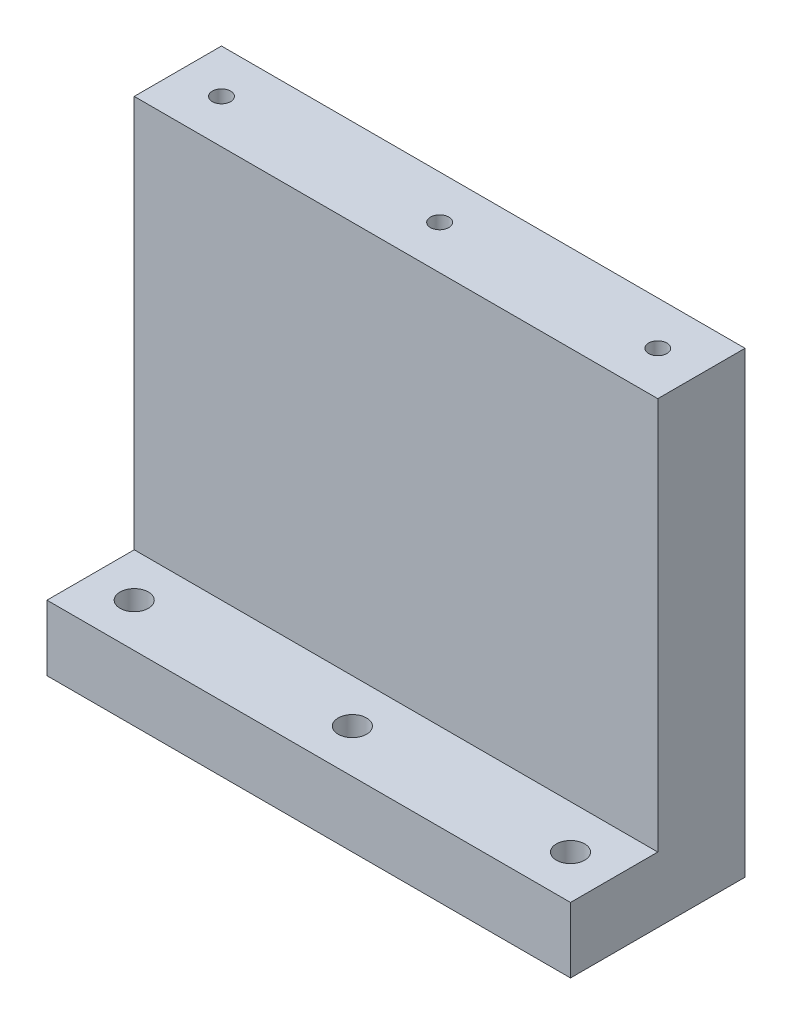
ISO-10303-21;
HEADER;
FILE_DESCRIPTION(('STEP AP214'),'2;1');
FILE_NAME('part.step','',(''),(''),'','','');
FILE_SCHEMA(('AUTOMOTIVE_DESIGN { 1 0 10303 214 1 1 1 1 }'));
ENDSEC;
DATA;
#1=APPLICATION_CONTEXT('core data for automotive mechanical design processes');
#2=APPLICATION_PROTOCOL_DEFINITION('international standard','automotive_design',2000,#1);
#3=PRODUCT_CONTEXT('',#1,'mechanical');
#4=PRODUCT('Part','Part','',(#3));
#5=PRODUCT_RELATED_PRODUCT_CATEGORY('part','',(#4));
#6=PRODUCT_DEFINITION_FORMATION('','',#4);
#7=PRODUCT_DEFINITION_CONTEXT('part definition',#1,'design');
#8=PRODUCT_DEFINITION('design','',#6,#7);
#9=PRODUCT_DEFINITION_SHAPE('','',#8);
#10=(LENGTH_UNIT() NAMED_UNIT(*) SI_UNIT(.MILLI.,.METRE.));
#11=(NAMED_UNIT(*) PLANE_ANGLE_UNIT() SI_UNIT($,.RADIAN.));
#12=(NAMED_UNIT(*) SI_UNIT($,.STERADIAN.) SOLID_ANGLE_UNIT());
#13=UNCERTAINTY_MEASURE_WITH_UNIT(LENGTH_MEASURE(1.E-05),#10,'distance_accuracy_value','');
#14=(GEOMETRIC_REPRESENTATION_CONTEXT(3) GLOBAL_UNCERTAINTY_ASSIGNED_CONTEXT((#13)) GLOBAL_UNIT_ASSIGNED_CONTEXT((#10,
#11,#12)) REPRESENTATION_CONTEXT('',''));
#15=CARTESIAN_POINT('',(0.,0.,0.));
#16=DIRECTION('',(0.,0.,1.));
#17=DIRECTION('',(1.,0.,0.));
#18=AXIS2_PLACEMENT_3D('',#15,#16,#17);
#19=CARTESIAN_POINT('',(0.,0.,40.));
#20=DIRECTION('',(1.,0.,0.));
#21=DIRECTION('',(0.,0.,-1.));
#22=AXIS2_PLACEMENT_3D('',#19,#20,#21);
#23=PLANE('',#22);
#24=DIRECTION('',(0.,0.,1.));
#25=VECTOR('',#24,1.);
#26=CARTESIAN_POINT('',(0.,15.,40.));
#27=LINE('',#26,#25);
#28=CARTESIAN_POINT('',(0.,15.,20.));
#29=VERTEX_POINT('',#28);
#30=CARTESIAN_POINT('',(0.,15.,40.));
#31=VERTEX_POINT('',#30);
#32=EDGE_CURVE('E47',#29,#31,#27,.T.);
#33=ORIENTED_EDGE('',*,*,#32,.F.);
#34=DIRECTION('',(0.,-1.,0.));
#35=VECTOR('',#34,1.);
#36=CARTESIAN_POINT('',(0.,15.,20.));
#37=LINE('',#36,#35);
#38=CARTESIAN_POINT('',(0.,105.,20.));
#39=VERTEX_POINT('',#38);
#40=EDGE_CURVE('E83',#39,#29,#37,.T.);
#41=ORIENTED_EDGE('',*,*,#40,.F.);
#42=DIRECTION('',(0.,0.,-1.));
#43=VECTOR('',#42,1.);
#44=CARTESIAN_POINT('',(0.,105.,40.));
#45=LINE('',#44,#43);
#46=CARTESIAN_POINT('',(0.,105.,0.));
#47=VERTEX_POINT('',#46);
#48=EDGE_CURVE('E76',#39,#47,#45,.T.);
#49=ORIENTED_EDGE('',*,*,#48,.T.);
#50=DIRECTION('',(0.,-1.,0.));
#51=VECTOR('',#50,1.);
#52=CARTESIAN_POINT('',(0.,0.,0.));
#53=LINE('',#52,#51);
#54=CARTESIAN_POINT('',(0.,0.,0.));
#55=VERTEX_POINT('',#54);
#56=EDGE_CURVE('E80',#47,#55,#53,.T.);
#57=ORIENTED_EDGE('',*,*,#56,.T.);
#58=DIRECTION('',(0.,0.,-1.));
#59=VECTOR('',#58,1.);
#60=CARTESIAN_POINT('',(0.,0.,40.));
#61=LINE('',#60,#59);
#62=CARTESIAN_POINT('',(0.,0.,40.));
#63=VERTEX_POINT('',#62);
#64=EDGE_CURVE('E12',#63,#55,#61,.T.);
#65=ORIENTED_EDGE('',*,*,#64,.F.);
#66=DIRECTION('',(0.,-1.,0.));
#67=VECTOR('',#66,1.);
#68=CARTESIAN_POINT('',(0.,0.,40.));
#69=LINE('',#68,#67);
#70=EDGE_CURVE('E96',#31,#63,#69,.T.);
#71=ORIENTED_EDGE('',*,*,#70,.F.);
#72=EDGE_LOOP('',(#33,#41,#49,#57,#65,#71));
#73=FACE_BOUND('',#72,.T.);
#74=ADVANCED_FACE('F33',(#73),#23,.F.);
#75=CARTESIAN_POINT('',(120.,0.,40.));
#76=DIRECTION('',(-1.,0.,0.));
#77=DIRECTION('',(0.,0.,1.));
#78=AXIS2_PLACEMENT_3D('',#75,#76,#77);
#79=PLANE('',#78);
#80=DIRECTION('',(0.,0.,1.));
#81=VECTOR('',#80,1.);
#82=CARTESIAN_POINT('',(120.,15.,40.));
#83=LINE('',#82,#81);
#84=CARTESIAN_POINT('',(120.,15.,20.));
#85=VERTEX_POINT('',#84);
#86=CARTESIAN_POINT('',(120.,15.,40.));
#87=VERTEX_POINT('',#86);
#88=EDGE_CURVE('E128',#85,#87,#83,.T.);
#89=ORIENTED_EDGE('',*,*,#88,.T.);
#90=DIRECTION('',(0.,1.,0.));
#91=VECTOR('',#90,1.);
#92=CARTESIAN_POINT('',(120.,0.,40.));
#93=LINE('',#92,#91);
#94=CARTESIAN_POINT('',(120.,0.,40.));
#95=VERTEX_POINT('',#94);
#96=EDGE_CURVE('E87',#95,#87,#93,.T.);
#97=ORIENTED_EDGE('',*,*,#96,.F.);
#98=DIRECTION('',(0.,0.,-1.));
#99=VECTOR('',#98,1.);
#100=CARTESIAN_POINT('',(120.,0.,40.));
#101=LINE('',#100,#99);
#102=CARTESIAN_POINT('',(120.,0.,0.));
#103=VERTEX_POINT('',#102);
#104=EDGE_CURVE('E40',#95,#103,#101,.T.);
#105=ORIENTED_EDGE('',*,*,#104,.T.);
#106=DIRECTION('',(0.,1.,0.));
#107=VECTOR('',#106,1.);
#108=CARTESIAN_POINT('',(120.,0.,0.));
#109=LINE('',#108,#107);
#110=CARTESIAN_POINT('',(120.,105.,0.));
#111=VERTEX_POINT('',#110);
#112=EDGE_CURVE('E97',#103,#111,#109,.T.);
#113=ORIENTED_EDGE('',*,*,#112,.T.);
#114=DIRECTION('',(0.,0.,-1.));
#115=VECTOR('',#114,1.);
#116=CARTESIAN_POINT('',(120.,105.,40.));
#117=LINE('',#116,#115);
#118=CARTESIAN_POINT('',(120.,105.,20.));
#119=VERTEX_POINT('',#118);
#120=EDGE_CURVE('E86',#119,#111,#117,.T.);
#121=ORIENTED_EDGE('',*,*,#120,.F.);
#122=DIRECTION('',(0.,-1.,0.));
#123=VECTOR('',#122,1.);
#124=CARTESIAN_POINT('',(120.,15.,20.));
#125=LINE('',#124,#123);
#126=EDGE_CURVE('E125',#119,#85,#125,.T.);
#127=ORIENTED_EDGE('',*,*,#126,.T.);
#128=EDGE_LOOP('',(#89,#97,#105,#113,#121,#127));
#129=FACE_BOUND('',#128,.T.);
#130=ADVANCED_FACE('F115',(#129),#79,.F.);
#131=CARTESIAN_POINT('',(0.,105.,40.));
#132=DIRECTION('',(0.,-1.,0.));
#133=DIRECTION('',(0.,0.,-1.));
#134=AXIS2_PLACEMENT_3D('',#131,#132,#133);
#135=PLANE('',#134);
#136=CARTESIAN_POINT('',(110.,105.,10.));
#137=DIRECTION('',(0.,1.,0.));
#138=DIRECTION('',(0.,0.,1.));
#139=AXIS2_PLACEMENT_3D('',#136,#137,#138);
#140=CIRCLE('',#139,2.1);
#141=CARTESIAN_POINT('',(110.,105.,12.1));
#142=VERTEX_POINT('',#141);
#143=EDGE_CURVE('E163',#142,#142,#140,.T.);
#144=ORIENTED_EDGE('',*,*,#143,.F.);
#145=EDGE_LOOP('',(#144));
#146=FACE_BOUND('',#145,.T.);
#147=CARTESIAN_POINT('',(60.,105.,10.0000000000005));
#148=DIRECTION('',(0.,1.,0.));
#149=DIRECTION('',(0.,0.,1.));
#150=AXIS2_PLACEMENT_3D('',#147,#148,#149);
#151=CIRCLE('',#150,2.1);
#152=CARTESIAN_POINT('',(60.,105.,12.1000000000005));
#153=VERTEX_POINT('',#152);
#154=EDGE_CURVE('E157',#153,#153,#151,.T.);
#155=ORIENTED_EDGE('',*,*,#154,.F.);
#156=EDGE_LOOP('',(#155));
#157=FACE_BOUND('',#156,.T.);
#158=CARTESIAN_POINT('',(10.,105.,10.));
#159=DIRECTION('',(0.,1.,0.));
#160=DIRECTION('',(0.,0.,1.));
#161=AXIS2_PLACEMENT_3D('',#158,#159,#160);
#162=CIRCLE('',#161,2.1);
#163=CARTESIAN_POINT('',(10.,105.,12.1));
#164=VERTEX_POINT('',#163);
#165=EDGE_CURVE('E151',#164,#164,#162,.T.);
#166=ORIENTED_EDGE('',*,*,#165,.F.);
#167=EDGE_LOOP('',(#166));
#168=FACE_BOUND('',#167,.T.);
#169=DIRECTION('',(1.,0.,0.));
#170=VECTOR('',#169,1.);
#171=CARTESIAN_POINT('',(0.,105.,20.));
#172=LINE('',#171,#170);
#173=EDGE_CURVE('E105',#39,#119,#172,.T.);
#174=ORIENTED_EDGE('',*,*,#173,.T.);
#175=ORIENTED_EDGE('',*,*,#120,.T.);
#176=DIRECTION('',(-1.,0.,0.));
#177=VECTOR('',#176,1.);
#178=CARTESIAN_POINT('',(0.,105.,0.));
#179=LINE('',#178,#177);
#180=EDGE_CURVE('E90',#111,#47,#179,.T.);
#181=ORIENTED_EDGE('',*,*,#180,.T.);
#182=ORIENTED_EDGE('',*,*,#48,.F.);
#183=EDGE_LOOP('',(#174,#175,#181,#182));
#184=FACE_BOUND('',#183,.T.);
#185=ADVANCED_FACE('F91',(#146,#157,#168,#184),#135,.F.);
#186=CARTESIAN_POINT('',(0.,105.,40.));
#187=DIRECTION('',(0.,0.,-1.));
#188=DIRECTION('',(-1.,0.,0.));
#189=AXIS2_PLACEMENT_3D('',#186,#187,#188);
#190=PLANE('',#189);
#191=DIRECTION('',(1.,0.,0.));
#192=VECTOR('',#191,1.);
#193=CARTESIAN_POINT('',(0.,15.,40.));
#194=LINE('',#193,#192);
#195=EDGE_CURVE('E122',#31,#87,#194,.T.);
#196=ORIENTED_EDGE('',*,*,#195,.F.);
#197=ORIENTED_EDGE('',*,*,#70,.T.);
#198=DIRECTION('',(1.,0.,0.));
#199=VECTOR('',#198,1.);
#200=CARTESIAN_POINT('',(0.,0.,40.));
#201=LINE('',#200,#199);
#202=EDGE_CURVE('E56',#63,#95,#201,.T.);
#203=ORIENTED_EDGE('',*,*,#202,.T.);
#204=ORIENTED_EDGE('',*,*,#96,.T.);
#205=EDGE_LOOP('',(#196,#197,#203,#204));
#206=FACE_BOUND('',#205,.T.);
#207=ADVANCED_FACE('F180',(#206),#190,.F.);
#208=CARTESIAN_POINT('',(0.,0.,40.));
#209=DIRECTION('',(0.,1.,0.));
#210=DIRECTION('',(0.,0.,1.));
#211=AXIS2_PLACEMENT_3D('',#208,#209,#210);
#212=PLANE('',#211);
#213=CARTESIAN_POINT('',(10.,0.,30.));
#214=DIRECTION('',(0.,1.,0.));
#215=DIRECTION('',(0.,0.,1.));
#216=AXIS2_PLACEMENT_3D('',#213,#214,#215);
#217=CIRCLE('',#216,3.25);
#218=CARTESIAN_POINT('',(10.,0.,33.25));
#219=VERTEX_POINT('',#218);
#220=EDGE_CURVE('E144',#219,#219,#217,.T.);
#221=ORIENTED_EDGE('',*,*,#220,.T.);
#222=EDGE_LOOP('',(#221));
#223=FACE_BOUND('',#222,.T.);
#224=CARTESIAN_POINT('',(60.,0.,30.));
#225=DIRECTION('',(0.,1.,0.));
#226=DIRECTION('',(0.,0.,1.));
#227=AXIS2_PLACEMENT_3D('',#224,#225,#226);
#228=CIRCLE('',#227,3.25);
#229=CARTESIAN_POINT('',(60.,0.,33.25));
#230=VERTEX_POINT('',#229);
#231=EDGE_CURVE('E138',#230,#230,#228,.T.);
#232=ORIENTED_EDGE('',*,*,#231,.T.);
#233=EDGE_LOOP('',(#232));
#234=FACE_BOUND('',#233,.T.);
#235=CARTESIAN_POINT('',(110.,0.,30.));
#236=DIRECTION('',(0.,1.,0.));
#237=DIRECTION('',(0.,0.,1.));
#238=AXIS2_PLACEMENT_3D('',#235,#236,#237);
#239=CIRCLE('',#238,3.25);
#240=CARTESIAN_POINT('',(110.,0.,33.25));
#241=VERTEX_POINT('',#240);
#242=EDGE_CURVE('E130',#241,#241,#239,.T.);
#243=ORIENTED_EDGE('',*,*,#242,.T.);
#244=EDGE_LOOP('',(#243));
#245=FACE_BOUND('',#244,.T.);
#246=DIRECTION('',(1.,0.,0.));
#247=VECTOR('',#246,1.);
#248=CARTESIAN_POINT('',(0.,0.,0.));
#249=LINE('',#248,#247);
#250=EDGE_CURVE('E100',#55,#103,#249,.T.);
#251=ORIENTED_EDGE('',*,*,#250,.T.);
#252=ORIENTED_EDGE('',*,*,#104,.F.);
#253=ORIENTED_EDGE('',*,*,#202,.F.);
#254=ORIENTED_EDGE('',*,*,#64,.T.);
#255=EDGE_LOOP('',(#251,#252,#253,#254));
#256=FACE_BOUND('',#255,.T.);
#257=ADVANCED_FACE('F117',(#223,#234,#245,#256),#212,.F.);
#258=CARTESIAN_POINT('',(0.,105.,0.));
#259=DIRECTION('',(0.,0.,-1.));
#260=DIRECTION('',(-1.,0.,0.));
#261=AXIS2_PLACEMENT_3D('',#258,#259,#260);
#262=PLANE('',#261);
#263=ORIENTED_EDGE('',*,*,#56,.F.);
#264=ORIENTED_EDGE('',*,*,#180,.F.);
#265=ORIENTED_EDGE('',*,*,#112,.F.);
#266=ORIENTED_EDGE('',*,*,#250,.F.);
#267=EDGE_LOOP('',(#263,#264,#265,#266));
#268=FACE_BOUND('',#267,.T.);
#269=ADVANCED_FACE('F99',(#268),#262,.T.);
#270=CARTESIAN_POINT('',(0.,15.,40.));
#271=DIRECTION('',(0.,1.,0.));
#272=DIRECTION('',(0.,0.,1.));
#273=AXIS2_PLACEMENT_3D('',#270,#271,#272);
#274=PLANE('',#273);
#275=CARTESIAN_POINT('',(10.,15.,30.));
#276=DIRECTION('',(0.,1.,0.));
#277=DIRECTION('',(0.,0.,1.));
#278=AXIS2_PLACEMENT_3D('',#275,#276,#277);
#279=CIRCLE('',#278,3.25);
#280=CARTESIAN_POINT('',(10.,15.,33.25));
#281=VERTEX_POINT('',#280);
#282=EDGE_CURVE('E147',#281,#281,#279,.T.);
#283=ORIENTED_EDGE('',*,*,#282,.F.);
#284=EDGE_LOOP('',(#283));
#285=FACE_BOUND('',#284,.T.);
#286=CARTESIAN_POINT('',(60.,15.,30.));
#287=DIRECTION('',(0.,1.,0.));
#288=DIRECTION('',(0.,0.,1.));
#289=AXIS2_PLACEMENT_3D('',#286,#287,#288);
#290=CIRCLE('',#289,3.25);
#291=CARTESIAN_POINT('',(60.,15.,33.25));
#292=VERTEX_POINT('',#291);
#293=EDGE_CURVE('E141',#292,#292,#290,.T.);
#294=ORIENTED_EDGE('',*,*,#293,.F.);
#295=EDGE_LOOP('',(#294));
#296=FACE_BOUND('',#295,.T.);
#297=CARTESIAN_POINT('',(110.,15.,30.));
#298=DIRECTION('',(0.,1.,0.));
#299=DIRECTION('',(0.,0.,1.));
#300=AXIS2_PLACEMENT_3D('',#297,#298,#299);
#301=CIRCLE('',#300,3.25);
#302=CARTESIAN_POINT('',(110.,15.,33.25));
#303=VERTEX_POINT('',#302);
#304=EDGE_CURVE('E135',#303,#303,#301,.T.);
#305=ORIENTED_EDGE('',*,*,#304,.F.);
#306=EDGE_LOOP('',(#305));
#307=FACE_BOUND('',#306,.T.);
#308=ORIENTED_EDGE('',*,*,#88,.F.);
#309=DIRECTION('',(1.,0.,0.));
#310=VECTOR('',#309,1.);
#311=CARTESIAN_POINT('',(0.,15.,20.));
#312=LINE('',#311,#310);
#313=EDGE_CURVE('E101',#29,#85,#312,.T.);
#314=ORIENTED_EDGE('',*,*,#313,.F.);
#315=ORIENTED_EDGE('',*,*,#32,.T.);
#316=ORIENTED_EDGE('',*,*,#195,.T.);
#317=EDGE_LOOP('',(#308,#314,#315,#316));
#318=FACE_BOUND('',#317,.T.);
#319=ADVANCED_FACE('F217',(#285,#296,#307,#318),#274,.T.);
#320=CARTESIAN_POINT('',(0.,15.,20.));
#321=DIRECTION('',(0.,0.,1.));
#322=DIRECTION('',(1.,0.,0.));
#323=AXIS2_PLACEMENT_3D('',#320,#321,#322);
#324=PLANE('',#323);
#325=ORIENTED_EDGE('',*,*,#126,.F.);
#326=ORIENTED_EDGE('',*,*,#173,.F.);
#327=ORIENTED_EDGE('',*,*,#40,.T.);
#328=ORIENTED_EDGE('',*,*,#313,.T.);
#329=EDGE_LOOP('',(#325,#326,#327,#328));
#330=FACE_BOUND('',#329,.T.);
#331=ADVANCED_FACE('F227',(#330),#324,.T.);
#332=CARTESIAN_POINT('',(110.,-25.,30.));
#333=DIRECTION('',(0.,1.,0.));
#334=DIRECTION('',(0.,0.,1.));
#335=AXIS2_PLACEMENT_3D('',#332,#333,#334);
#336=CYLINDRICAL_SURFACE('',#335,3.25);
#337=ORIENTED_EDGE('',*,*,#304,.T.);
#338=EDGE_LOOP('',(#337));
#339=FACE_BOUND('',#338,.T.);
#340=ORIENTED_EDGE('',*,*,#242,.F.);
#341=EDGE_LOOP('',(#340));
#342=FACE_BOUND('',#341,.T.);
#343=ADVANCED_FACE('F225',(#339,#342),#336,.F.);
#344=CARTESIAN_POINT('',(60.,-25.,30.));
#345=DIRECTION('',(0.,1.,0.));
#346=DIRECTION('',(0.,0.,1.));
#347=AXIS2_PLACEMENT_3D('',#344,#345,#346);
#348=CYLINDRICAL_SURFACE('',#347,3.25);
#349=ORIENTED_EDGE('',*,*,#293,.T.);
#350=EDGE_LOOP('',(#349));
#351=FACE_BOUND('',#350,.T.);
#352=ORIENTED_EDGE('',*,*,#231,.F.);
#353=EDGE_LOOP('',(#352));
#354=FACE_BOUND('',#353,.T.);
#355=ADVANCED_FACE('F199',(#351,#354),#348,.F.);
#356=CARTESIAN_POINT('',(10.,-25.,30.));
#357=DIRECTION('',(0.,1.,0.));
#358=DIRECTION('',(0.,0.,1.));
#359=AXIS2_PLACEMENT_3D('',#356,#357,#358);
#360=CYLINDRICAL_SURFACE('',#359,3.25);
#361=ORIENTED_EDGE('',*,*,#282,.T.);
#362=EDGE_LOOP('',(#361));
#363=FACE_BOUND('',#362,.T.);
#364=ORIENTED_EDGE('',*,*,#220,.F.);
#365=EDGE_LOOP('',(#364));
#366=FACE_BOUND('',#365,.T.);
#367=ADVANCED_FACE('F189',(#363,#366),#360,.F.);
#368=CARTESIAN_POINT('',(10.,89.9999999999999,10.));
#369=DIRECTION('',(0.,1.,0.));
#370=DIRECTION('',(0.,0.,1.));
#371=AXIS2_PLACEMENT_3D('',#368,#369,#370);
#372=CYLINDRICAL_SURFACE('',#371,2.1);
#373=CARTESIAN_POINT('',(10.,89.9999999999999,10.));
#374=DIRECTION('',(0.,1.,0.));
#375=DIRECTION('',(0.,0.,1.));
#376=AXIS2_PLACEMENT_3D('',#373,#374,#375);
#377=CIRCLE('',#376,2.1);
#378=CARTESIAN_POINT('',(10.,89.9999999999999,12.1));
#379=VERTEX_POINT('',#378);
#380=EDGE_CURVE('E150',#379,#379,#377,.T.);
#381=ORIENTED_EDGE('',*,*,#380,.F.);
#382=EDGE_LOOP('',(#381));
#383=FACE_BOUND('',#382,.T.);
#384=ORIENTED_EDGE('',*,*,#165,.T.);
#385=EDGE_LOOP('',(#384));
#386=FACE_BOUND('',#385,.T.);
#387=ADVANCED_FACE('F186',(#383,#386),#372,.F.);
#388=CARTESIAN_POINT('',(10.,89.9999999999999,10.));
#389=DIRECTION('',(0.,1.,0.));
#390=DIRECTION('',(0.,0.,1.));
#391=AXIS2_PLACEMENT_3D('',#388,#389,#390);
#392=PLANE('',#391);
#393=ORIENTED_EDGE('',*,*,#380,.T.);
#394=EDGE_LOOP('',(#393));
#395=FACE_BOUND('',#394,.T.);
#396=ADVANCED_FACE('F188',(#395),#392,.T.);
#397=CARTESIAN_POINT('',(60.,89.9999999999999,10.0000000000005));
#398=DIRECTION('',(0.,1.,0.));
#399=DIRECTION('',(0.,0.,1.));
#400=AXIS2_PLACEMENT_3D('',#397,#398,#399);
#401=CYLINDRICAL_SURFACE('',#400,2.1);
#402=CARTESIAN_POINT('',(60.,89.9999999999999,10.0000000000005));
#403=DIRECTION('',(0.,1.,0.));
#404=DIRECTION('',(0.,0.,1.));
#405=AXIS2_PLACEMENT_3D('',#402,#403,#404);
#406=CIRCLE('',#405,2.1);
#407=CARTESIAN_POINT('',(60.,89.9999999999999,12.1000000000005));
#408=VERTEX_POINT('',#407);
#409=EDGE_CURVE('E154',#408,#408,#406,.T.);
#410=ORIENTED_EDGE('',*,*,#409,.F.);
#411=EDGE_LOOP('',(#410));
#412=FACE_BOUND('',#411,.T.);
#413=ORIENTED_EDGE('',*,*,#154,.T.);
#414=EDGE_LOOP('',(#413));
#415=FACE_BOUND('',#414,.T.);
#416=ADVANCED_FACE('F196',(#412,#415),#401,.F.);
#417=CARTESIAN_POINT('',(60.,89.9999999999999,10.0000000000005));
#418=DIRECTION('',(0.,1.,0.));
#419=DIRECTION('',(0.,0.,1.));
#420=AXIS2_PLACEMENT_3D('',#417,#418,#419);
#421=PLANE('',#420);
#422=ORIENTED_EDGE('',*,*,#409,.T.);
#423=EDGE_LOOP('',(#422));
#424=FACE_BOUND('',#423,.T.);
#425=ADVANCED_FACE('F174',(#424),#421,.T.);
#426=CARTESIAN_POINT('',(110.,89.9999999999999,10.));
#427=DIRECTION('',(0.,1.,0.));
#428=DIRECTION('',(0.,0.,1.));
#429=AXIS2_PLACEMENT_3D('',#426,#427,#428);
#430=CYLINDRICAL_SURFACE('',#429,2.1);
#431=CARTESIAN_POINT('',(110.,89.9999999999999,10.));
#432=DIRECTION('',(0.,1.,0.));
#433=DIRECTION('',(0.,0.,1.));
#434=AXIS2_PLACEMENT_3D('',#431,#432,#433);
#435=CIRCLE('',#434,2.1);
#436=CARTESIAN_POINT('',(110.,89.9999999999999,12.1));
#437=VERTEX_POINT('',#436);
#438=EDGE_CURVE('E160',#437,#437,#435,.T.);
#439=ORIENTED_EDGE('',*,*,#438,.F.);
#440=EDGE_LOOP('',(#439));
#441=FACE_BOUND('',#440,.T.);
#442=ORIENTED_EDGE('',*,*,#143,.T.);
#443=EDGE_LOOP('',(#442));
#444=FACE_BOUND('',#443,.T.);
#445=ADVANCED_FACE('F171',(#441,#444),#430,.F.);
#446=CARTESIAN_POINT('',(110.,89.9999999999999,10.));
#447=DIRECTION('',(0.,1.,0.));
#448=DIRECTION('',(0.,0.,1.));
#449=AXIS2_PLACEMENT_3D('',#446,#447,#448);
#450=PLANE('',#449);
#451=ORIENTED_EDGE('',*,*,#438,.T.);
#452=EDGE_LOOP('',(#451));
#453=FACE_BOUND('',#452,.T.);
#454=ADVANCED_FACE('F169',(#453),#450,.T.);
#455=CLOSED_SHELL('',(#74,#130,#185,#207,#257,#269,#319,#331,#343,#355,#367,#387,#396,#416,#425,
#445,#454));
#456=MANIFOLD_SOLID_BREP('B2',#455);
#457=ADVANCED_BREP_SHAPE_REPRESENTATION('',(#18,#456),#14);
#458=SHAPE_DEFINITION_REPRESENTATION(#9,#457);
ENDSEC;
END-ISO-10303-21;
